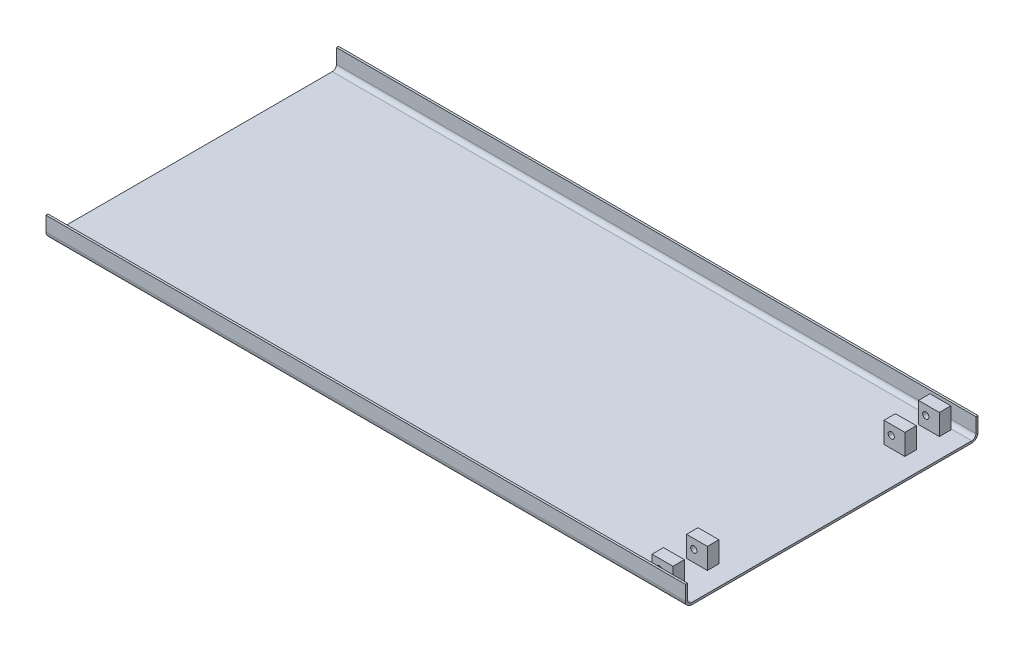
ISO-10303-21;
HEADER;
FILE_DESCRIPTION(('STEP AP214'),'2;1');
FILE_NAME('part.step','',(''),(''),'','','');
FILE_SCHEMA(('AUTOMOTIVE_DESIGN { 1 0 10303 214 1 1 1 1 }'));
ENDSEC;
DATA;
#1=APPLICATION_CONTEXT('core data for automotive mechanical design processes');
#2=APPLICATION_PROTOCOL_DEFINITION('international standard','automotive_design',2000,#1);
#3=PRODUCT_CONTEXT('',#1,'mechanical');
#4=PRODUCT('Part','Part','',(#3));
#5=PRODUCT_RELATED_PRODUCT_CATEGORY('part','',(#4));
#6=PRODUCT_DEFINITION_FORMATION('','',#4);
#7=PRODUCT_DEFINITION_CONTEXT('part definition',#1,'design');
#8=PRODUCT_DEFINITION('design','',#6,#7);
#9=PRODUCT_DEFINITION_SHAPE('','',#8);
#10=(LENGTH_UNIT() NAMED_UNIT(*) SI_UNIT(.MILLI.,.METRE.));
#11=(NAMED_UNIT(*) PLANE_ANGLE_UNIT() SI_UNIT($,.RADIAN.));
#12=(NAMED_UNIT(*) SI_UNIT($,.STERADIAN.) SOLID_ANGLE_UNIT());
#13=UNCERTAINTY_MEASURE_WITH_UNIT(LENGTH_MEASURE(1.E-05),#10,'distance_accuracy_value','');
#14=(GEOMETRIC_REPRESENTATION_CONTEXT(3) GLOBAL_UNCERTAINTY_ASSIGNED_CONTEXT((#13)) GLOBAL_UNIT_ASSIGNED_CONTEXT((#10,
#11,#12)) REPRESENTATION_CONTEXT('',''));
#15=CARTESIAN_POINT('',(0.,0.,0.));
#16=DIRECTION('',(0.,0.,1.));
#17=DIRECTION('',(1.,0.,0.));
#18=AXIS2_PLACEMENT_3D('',#15,#16,#17);
#19=CARTESIAN_POINT('',(1530.,10.,670.));
#20=DIRECTION('',(0.,-1.,0.));
#21=DIRECTION('',(0.,0.,-1.));
#22=AXIS2_PLACEMENT_3D('',#19,#20,#21);
#23=PLANE('',#22);
#24=DIRECTION('',(0.,0.,-1.));
#25=VECTOR('',#24,1.);
#26=CARTESIAN_POINT('',(1435.,10.,0.));
#27=LINE('',#26,#25);
#28=CARTESIAN_POINT('',(1435.,10.,-610.));
#29=VERTEX_POINT('',#28);
#30=CARTESIAN_POINT('',(1435.,10.,-665.));
#31=VERTEX_POINT('',#30);
#32=EDGE_CURVE('E258',#29,#31,#27,.T.);
#33=ORIENTED_EDGE('',*,*,#32,.F.);
#34=DIRECTION('',(-1.,0.,0.));
#35=VECTOR('',#34,1.);
#36=CARTESIAN_POINT('',(6.77236045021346E-13,10.,-610.000000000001));
#37=LINE('',#36,#35);
#38=CARTESIAN_POINT('',(1335.,10.,-610.));
#39=VERTEX_POINT('',#38);
#40=EDGE_CURVE('E230',#29,#39,#37,.T.);
#41=ORIENTED_EDGE('',*,*,#40,.T.);
#42=DIRECTION('',(0.,0.,-1.));
#43=VECTOR('',#42,1.);
#44=CARTESIAN_POINT('',(1335.,10.,0.));
#45=LINE('',#44,#43);
#46=CARTESIAN_POINT('',(1335.,10.,-665.));
#47=VERTEX_POINT('',#46);
#48=EDGE_CURVE('E246',#39,#47,#45,.T.);
#49=ORIENTED_EDGE('',*,*,#48,.T.);
#50=DIRECTION('',(-1.,0.,0.));
#51=VECTOR('',#50,1.);
#52=CARTESIAN_POINT('',(-7.38298311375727E-13,10.,-664.999999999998));
#53=LINE('',#52,#51);
#54=EDGE_CURVE('E50',#31,#47,#53,.T.);
#55=ORIENTED_EDGE('',*,*,#54,.F.);
#56=EDGE_LOOP('',(#33,#41,#49,#55));
#57=FACE_BOUND('',#56,.T.);
#58=DIRECTION('',(0.,0.,-1.));
#59=VECTOR('',#58,1.);
#60=CARTESIAN_POINT('',(1435.,10.,0.));
#61=LINE('',#60,#59);
#62=CARTESIAN_POINT('',(1435.,10.,-445.));
#63=VERTEX_POINT('',#62);
#64=CARTESIAN_POINT('',(1435.,10.,-500.));
#65=VERTEX_POINT('',#64);
#66=EDGE_CURVE('E279',#63,#65,#61,.T.);
#67=ORIENTED_EDGE('',*,*,#66,.F.);
#68=DIRECTION('',(-1.,0.,0.));
#69=VECTOR('',#68,1.);
#70=CARTESIAN_POINT('',(4.94049245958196E-13,10.,-445.000000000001));
#71=LINE('',#70,#69);
#72=CARTESIAN_POINT('',(1335.,10.,-445.));
#73=VERTEX_POINT('',#72);
#74=EDGE_CURVE('E233',#63,#73,#71,.T.);
#75=ORIENTED_EDGE('',*,*,#74,.T.);
#76=DIRECTION('',(0.,0.,-1.));
#77=VECTOR('',#76,1.);
#78=CARTESIAN_POINT('',(1335.,10.,0.));
#79=LINE('',#78,#77);
#80=CARTESIAN_POINT('',(1335.,10.,-500.));
#81=VERTEX_POINT('',#80);
#82=EDGE_CURVE('E269',#73,#81,#79,.T.);
#83=ORIENTED_EDGE('',*,*,#82,.T.);
#84=DIRECTION('',(-1.,0.,0.));
#85=VECTOR('',#84,1.);
#86=CARTESIAN_POINT('',(-5.55111512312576E-13,10.,-499.999999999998));
#87=LINE('',#86,#85);
#88=EDGE_CURVE('E58',#65,#81,#87,.T.);
#89=ORIENTED_EDGE('',*,*,#88,.F.);
#90=EDGE_LOOP('',(#67,#75,#83,#89));
#91=FACE_BOUND('',#90,.T.);
#92=DIRECTION('',(-1.,0.,0.));
#93=VECTOR('',#92,1.);
#94=CARTESIAN_POINT('',(6.77236045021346E-13,10.,610.000000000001));
#95=LINE('',#94,#93);
#96=CARTESIAN_POINT('',(1435.,10.,610.));
#97=VERTEX_POINT('',#96);
#98=CARTESIAN_POINT('',(1335.,10.,610.));
#99=VERTEX_POINT('',#98);
#100=EDGE_CURVE('E323',#97,#99,#95,.T.);
#101=ORIENTED_EDGE('',*,*,#100,.F.);
#102=DIRECTION('',(0.,0.,1.));
#103=VECTOR('',#102,1.);
#104=CARTESIAN_POINT('',(1435.,10.,0.));
#105=LINE('',#104,#103);
#106=CARTESIAN_POINT('',(1435.,10.,665.));
#107=VERTEX_POINT('',#106);
#108=EDGE_CURVE('E328',#97,#107,#105,.T.);
#109=ORIENTED_EDGE('',*,*,#108,.T.);
#110=DIRECTION('',(-1.,0.,0.));
#111=VECTOR('',#110,1.);
#112=CARTESIAN_POINT('',(-7.38298311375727E-13,10.,664.999999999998));
#113=LINE('',#112,#111);
#114=CARTESIAN_POINT('',(1335.,10.,665.));
#115=VERTEX_POINT('',#114);
#116=EDGE_CURVE('E342',#107,#115,#113,.T.);
#117=ORIENTED_EDGE('',*,*,#116,.T.);
#118=DIRECTION('',(0.,0.,1.));
#119=VECTOR('',#118,1.);
#120=CARTESIAN_POINT('',(1335.,10.,0.));
#121=LINE('',#120,#119);
#122=EDGE_CURVE('E339',#99,#115,#121,.T.);
#123=ORIENTED_EDGE('',*,*,#122,.F.);
#124=EDGE_LOOP('',(#101,#109,#117,#123));
#125=FACE_BOUND('',#124,.T.);
#126=DIRECTION('',(0.,0.,-1.));
#127=VECTOR('',#126,1.);
#128=CARTESIAN_POINT('',(-1530.,10.,670.));
#129=LINE('',#128,#127);
#130=CARTESIAN_POINT('',(-1530.,10.,-670.));
#131=VERTEX_POINT('',#130);
#132=CARTESIAN_POINT('',(-1530.,9.99999999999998,670.));
#133=VERTEX_POINT('',#132);
#134=EDGE_CURVE('E416',#131,#133,#129,.F.);
#135=ORIENTED_EDGE('',*,*,#134,.T.);
#136=DIRECTION('',(-1.,0.,0.));
#137=VECTOR('',#136,1.);
#138=CARTESIAN_POINT('',(1530.,9.99999999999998,670.));
#139=LINE('',#138,#137);
#140=CARTESIAN_POINT('',(1530.,9.99999999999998,670.));
#141=VERTEX_POINT('',#140);
#142=EDGE_CURVE('E421',#141,#133,#139,.T.);
#143=ORIENTED_EDGE('',*,*,#142,.F.);
#144=DIRECTION('',(0.,0.,-1.));
#145=VECTOR('',#144,1.);
#146=CARTESIAN_POINT('',(1530.,10.,670.));
#147=LINE('',#146,#145);
#148=CARTESIAN_POINT('',(1530.,10.,-670.));
#149=VERTEX_POINT('',#148);
#150=EDGE_CURVE('E384',#149,#141,#147,.F.);
#151=ORIENTED_EDGE('',*,*,#150,.F.);
#152=DIRECTION('',(-1.,0.,0.));
#153=VECTOR('',#152,1.);
#154=CARTESIAN_POINT('',(1530.,10.,-670.));
#155=LINE('',#154,#153);
#156=EDGE_CURVE('E424',#149,#131,#155,.T.);
#157=ORIENTED_EDGE('',*,*,#156,.T.);
#158=EDGE_LOOP('',(#135,#143,#151,#157));
#159=FACE_BOUND('',#158,.T.);
#160=DIRECTION('',(-1.,0.,0.));
#161=VECTOR('',#160,1.);
#162=CARTESIAN_POINT('',(4.94049245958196E-13,10.,445.000000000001));
#163=LINE('',#162,#161);
#164=CARTESIAN_POINT('',(1435.,10.,445.));
#165=VERTEX_POINT('',#164);
#166=CARTESIAN_POINT('',(1335.,10.,445.));
#167=VERTEX_POINT('',#166);
#168=EDGE_CURVE('E291',#165,#167,#163,.T.);
#169=ORIENTED_EDGE('',*,*,#168,.F.);
#170=DIRECTION('',(0.,0.,1.));
#171=VECTOR('',#170,1.);
#172=CARTESIAN_POINT('',(1435.,10.,0.));
#173=LINE('',#172,#171);
#174=CARTESIAN_POINT('',(1435.,10.,500.));
#175=VERTEX_POINT('',#174);
#176=EDGE_CURVE('E296',#165,#175,#173,.T.);
#177=ORIENTED_EDGE('',*,*,#176,.T.);
#178=DIRECTION('',(-1.,0.,0.));
#179=VECTOR('',#178,1.);
#180=CARTESIAN_POINT('',(-5.55111512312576E-13,10.,499.999999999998));
#181=LINE('',#180,#179);
#182=CARTESIAN_POINT('',(1335.,10.,500.));
#183=VERTEX_POINT('',#182);
#184=EDGE_CURVE('E310',#175,#183,#181,.T.);
#185=ORIENTED_EDGE('',*,*,#184,.T.);
#186=DIRECTION('',(0.,0.,1.));
#187=VECTOR('',#186,1.);
#188=CARTESIAN_POINT('',(1335.,10.,0.));
#189=LINE('',#188,#187);
#190=EDGE_CURVE('E307',#167,#183,#189,.T.);
#191=ORIENTED_EDGE('',*,*,#190,.F.);
#192=EDGE_LOOP('',(#169,#177,#185,#191));
#193=FACE_BOUND('',#192,.T.);
#194=ADVANCED_FACE('F35',(#57,#91,#125,#159,#193),#23,.F.);
#195=CARTESIAN_POINT('',(1530.,30.0000000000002,690.));
#196=DIRECTION('',(0.,0.,1.));
#197=DIRECTION('',(1.,0.,0.));
#198=AXIS2_PLACEMENT_3D('',#195,#196,#197);
#199=PLANE('',#198);
#200=DIRECTION('',(0.,1.,0.));
#201=VECTOR('',#200,1.);
#202=CARTESIAN_POINT('',(-1530.,30.0000000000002,690.));
#203=LINE('',#202,#201);
#204=CARTESIAN_POINT('',(-1530.,30.0000000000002,690.));
#205=VERTEX_POINT('',#204);
#206=CARTESIAN_POINT('',(-1530.,100.,690.));
#207=VERTEX_POINT('',#206);
#208=EDGE_CURVE('E355',#205,#207,#203,.T.);
#209=ORIENTED_EDGE('',*,*,#208,.T.);
#210=DIRECTION('',(-1.,0.,0.));
#211=VECTOR('',#210,1.);
#212=CARTESIAN_POINT('',(1530.,100.,690.));
#213=LINE('',#212,#211);
#214=CARTESIAN_POINT('',(1530.,100.,690.));
#215=VERTEX_POINT('',#214);
#216=EDGE_CURVE('E11',#215,#207,#213,.T.);
#217=ORIENTED_EDGE('',*,*,#216,.F.);
#218=DIRECTION('',(0.,1.,0.));
#219=VECTOR('',#218,1.);
#220=CARTESIAN_POINT('',(1530.,30.0000000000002,690.));
#221=LINE('',#220,#219);
#222=CARTESIAN_POINT('',(1530.,30.0000000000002,690.));
#223=VERTEX_POINT('',#222);
#224=EDGE_CURVE('E356',#223,#215,#221,.T.);
#225=ORIENTED_EDGE('',*,*,#224,.F.);
#226=DIRECTION('',(-1.,0.,0.));
#227=VECTOR('',#226,1.);
#228=CARTESIAN_POINT('',(1530.,30.0000000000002,690.));
#229=LINE('',#228,#227);
#230=EDGE_CURVE('E388',#223,#205,#229,.T.);
#231=ORIENTED_EDGE('',*,*,#230,.T.);
#232=EDGE_LOOP('',(#209,#217,#225,#231));
#233=FACE_BOUND('',#232,.T.);
#234=ADVANCED_FACE('F37',(#233),#199,.F.);
#235=CARTESIAN_POINT('',(1530.,100.,700.));
#236=DIRECTION('',(0.,1.,0.));
#237=DIRECTION('',(0.,0.,1.));
#238=AXIS2_PLACEMENT_3D('',#235,#236,#237);
#239=PLANE('',#238);
#240=DIRECTION('',(0.,0.,-1.));
#241=VECTOR('',#240,1.);
#242=CARTESIAN_POINT('',(-1530.,100.,700.));
#243=LINE('',#242,#241);
#244=CARTESIAN_POINT('',(-1530.,100.,700.));
#245=VERTEX_POINT('',#244);
#246=EDGE_CURVE('E391',#245,#207,#243,.T.);
#247=ORIENTED_EDGE('',*,*,#246,.F.);
#248=DIRECTION('',(-1.,0.,0.));
#249=VECTOR('',#248,1.);
#250=CARTESIAN_POINT('',(1530.,100.,700.));
#251=LINE('',#250,#249);
#252=CARTESIAN_POINT('',(1530.,100.,700.));
#253=VERTEX_POINT('',#252);
#254=EDGE_CURVE('E43',#253,#245,#251,.T.);
#255=ORIENTED_EDGE('',*,*,#254,.F.);
#256=DIRECTION('',(0.,0.,-1.));
#257=VECTOR('',#256,1.);
#258=CARTESIAN_POINT('',(1530.,100.,700.));
#259=LINE('',#258,#257);
#260=EDGE_CURVE('E358',#253,#215,#259,.T.);
#261=ORIENTED_EDGE('',*,*,#260,.T.);
#262=ORIENTED_EDGE('',*,*,#216,.T.);
#263=EDGE_LOOP('',(#247,#255,#261,#262));
#264=FACE_BOUND('',#263,.T.);
#265=ADVANCED_FACE('F448',(#264),#239,.T.);
#266=CARTESIAN_POINT('',(1530.,30.0000000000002,700.));
#267=DIRECTION('',(0.,0.,1.));
#268=DIRECTION('',(1.,0.,0.));
#269=AXIS2_PLACEMENT_3D('',#266,#267,#268);
#270=PLANE('',#269);
#271=DIRECTION('',(0.,1.,0.));
#272=VECTOR('',#271,1.);
#273=CARTESIAN_POINT('',(-1530.,30.0000000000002,700.));
#274=LINE('',#273,#272);
#275=CARTESIAN_POINT('',(-1530.,30.0000000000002,700.));
#276=VERTEX_POINT('',#275);
#277=EDGE_CURVE('E394',#276,#245,#274,.T.);
#278=ORIENTED_EDGE('',*,*,#277,.F.);
#279=DIRECTION('',(-1.,0.,0.));
#280=VECTOR('',#279,1.);
#281=CARTESIAN_POINT('',(1530.,30.0000000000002,700.));
#282=LINE('',#281,#280);
#283=CARTESIAN_POINT('',(1530.,30.0000000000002,700.));
#284=VERTEX_POINT('',#283);
#285=EDGE_CURVE('E440',#284,#276,#282,.T.);
#286=ORIENTED_EDGE('',*,*,#285,.F.);
#287=DIRECTION('',(0.,1.,0.));
#288=VECTOR('',#287,1.);
#289=CARTESIAN_POINT('',(1530.,30.0000000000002,700.));
#290=LINE('',#289,#288);
#291=EDGE_CURVE('E362',#284,#253,#290,.T.);
#292=ORIENTED_EDGE('',*,*,#291,.T.);
#293=ORIENTED_EDGE('',*,*,#254,.T.);
#294=EDGE_LOOP('',(#278,#286,#292,#293));
#295=FACE_BOUND('',#294,.T.);
#296=ADVANCED_FACE('F444',(#295),#270,.T.);
#297=CARTESIAN_POINT('',(1530.,30.,670.));
#298=DIRECTION('',(-1.,0.,0.));
#299=DIRECTION('',(0.,0.,1.));
#300=AXIS2_PLACEMENT_3D('',#297,#298,#299);
#301=CYLINDRICAL_SURFACE('',#300,30.);
#302=CARTESIAN_POINT('',(-1530.,30.,670.));
#303=DIRECTION('',(-1.,0.,0.));
#304=DIRECTION('',(0.,0.,-1.));
#305=AXIS2_PLACEMENT_3D('',#302,#303,#304);
#306=CIRCLE('',#305,30.);
#307=CARTESIAN_POINT('',(-1530.,0.,670.));
#308=VERTEX_POINT('',#307);
#309=EDGE_CURVE('E397',#308,#276,#306,.T.);
#310=ORIENTED_EDGE('',*,*,#309,.F.);
#311=DIRECTION('',(-1.,0.,0.));
#312=VECTOR('',#311,1.);
#313=CARTESIAN_POINT('',(1530.,0.,670.));
#314=LINE('',#313,#312);
#315=CARTESIAN_POINT('',(1530.,0.,670.));
#316=VERTEX_POINT('',#315);
#317=EDGE_CURVE('E438',#316,#308,#314,.T.);
#318=ORIENTED_EDGE('',*,*,#317,.F.);
#319=CARTESIAN_POINT('',(1530.,30.,670.));
#320=DIRECTION('',(-1.,0.,0.));
#321=DIRECTION('',(0.,0.,-1.));
#322=AXIS2_PLACEMENT_3D('',#319,#320,#321);
#323=CIRCLE('',#322,30.);
#324=EDGE_CURVE('E365',#316,#284,#323,.T.);
#325=ORIENTED_EDGE('',*,*,#324,.T.);
#326=ORIENTED_EDGE('',*,*,#285,.T.);
#327=EDGE_LOOP('',(#310,#318,#325,#326));
#328=FACE_BOUND('',#327,.T.);
#329=ADVANCED_FACE('F456',(#328),#301,.T.);
#330=CARTESIAN_POINT('',(1530.,0.,670.));
#331=DIRECTION('',(0.,-1.,0.));
#332=DIRECTION('',(0.,0.,-1.));
#333=AXIS2_PLACEMENT_3D('',#330,#331,#332);
#334=PLANE('',#333);
#335=DIRECTION('',(0.,0.,1.));
#336=VECTOR('',#335,1.);
#337=CARTESIAN_POINT('',(-1530.,0.,670.));
#338=LINE('',#337,#336);
#339=CARTESIAN_POINT('',(-1530.,0.,-670.));
#340=VERTEX_POINT('',#339);
#341=EDGE_CURVE('E400',#340,#308,#338,.T.);
#342=ORIENTED_EDGE('',*,*,#341,.F.);
#343=DIRECTION('',(-1.,0.,0.));
#344=VECTOR('',#343,1.);
#345=CARTESIAN_POINT('',(1530.,0.,-670.));
#346=LINE('',#345,#344);
#347=CARTESIAN_POINT('',(1530.,0.,-670.));
#348=VERTEX_POINT('',#347);
#349=EDGE_CURVE('E436',#348,#340,#346,.T.);
#350=ORIENTED_EDGE('',*,*,#349,.F.);
#351=DIRECTION('',(0.,0.,1.));
#352=VECTOR('',#351,1.);
#353=CARTESIAN_POINT('',(1530.,0.,670.));
#354=LINE('',#353,#352);
#355=EDGE_CURVE('E368',#348,#316,#354,.T.);
#356=ORIENTED_EDGE('',*,*,#355,.T.);
#357=ORIENTED_EDGE('',*,*,#317,.T.);
#358=EDGE_LOOP('',(#342,#350,#356,#357));
#359=FACE_BOUND('',#358,.T.);
#360=ADVANCED_FACE('F495',(#359),#334,.T.);
#361=CARTESIAN_POINT('',(1530.,30.,-670.));
#362=DIRECTION('',(-1.,0.,0.));
#363=DIRECTION('',(0.,0.,1.));
#364=AXIS2_PLACEMENT_3D('',#361,#362,#363);
#365=CYLINDRICAL_SURFACE('',#364,30.);
#366=CARTESIAN_POINT('',(-1530.,30.,-670.));
#367=DIRECTION('',(-1.,0.,0.));
#368=DIRECTION('',(0.,0.,-1.));
#369=AXIS2_PLACEMENT_3D('',#366,#367,#368);
#370=CIRCLE('',#369,30.);
#371=CARTESIAN_POINT('',(-1530.,30.0000000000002,-700.));
#372=VERTEX_POINT('',#371);
#373=EDGE_CURVE('E403',#372,#340,#370,.T.);
#374=ORIENTED_EDGE('',*,*,#373,.F.);
#375=DIRECTION('',(-1.,0.,0.));
#376=VECTOR('',#375,1.);
#377=CARTESIAN_POINT('',(1530.,30.0000000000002,-700.));
#378=LINE('',#377,#376);
#379=CARTESIAN_POINT('',(1530.,30.0000000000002,-700.));
#380=VERTEX_POINT('',#379);
#381=EDGE_CURVE('E434',#380,#372,#378,.T.);
#382=ORIENTED_EDGE('',*,*,#381,.F.);
#383=CARTESIAN_POINT('',(1530.,30.,-670.));
#384=DIRECTION('',(-1.,0.,0.));
#385=DIRECTION('',(0.,0.,-1.));
#386=AXIS2_PLACEMENT_3D('',#383,#384,#385);
#387=CIRCLE('',#386,30.);
#388=EDGE_CURVE('E371',#380,#348,#387,.T.);
#389=ORIENTED_EDGE('',*,*,#388,.T.);
#390=ORIENTED_EDGE('',*,*,#349,.T.);
#391=EDGE_LOOP('',(#374,#382,#389,#390));
#392=FACE_BOUND('',#391,.T.);
#393=ADVANCED_FACE('F492',(#392),#365,.T.);
#394=CARTESIAN_POINT('',(1530.,30.0000000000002,-700.));
#395=DIRECTION('',(0.,0.,-1.));
#396=DIRECTION('',(-1.,0.,0.));
#397=AXIS2_PLACEMENT_3D('',#394,#395,#396);
#398=PLANE('',#397);
#399=DIRECTION('',(0.,-1.,0.));
#400=VECTOR('',#399,1.);
#401=CARTESIAN_POINT('',(-1530.,30.0000000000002,-700.));
#402=LINE('',#401,#400);
#403=CARTESIAN_POINT('',(-1530.,100.,-700.));
#404=VERTEX_POINT('',#403);
#405=EDGE_CURVE('E406',#404,#372,#402,.T.);
#406=ORIENTED_EDGE('',*,*,#405,.F.);
#407=DIRECTION('',(-1.,0.,0.));
#408=VECTOR('',#407,1.);
#409=CARTESIAN_POINT('',(1530.,100.,-700.));
#410=LINE('',#409,#408);
#411=CARTESIAN_POINT('',(1530.,100.,-700.));
#412=VERTEX_POINT('',#411);
#413=EDGE_CURVE('E432',#412,#404,#410,.T.);
#414=ORIENTED_EDGE('',*,*,#413,.F.);
#415=DIRECTION('',(0.,-1.,0.));
#416=VECTOR('',#415,1.);
#417=CARTESIAN_POINT('',(1530.,30.0000000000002,-700.));
#418=LINE('',#417,#416);
#419=EDGE_CURVE('E374',#412,#380,#418,.T.);
#420=ORIENTED_EDGE('',*,*,#419,.T.);
#421=ORIENTED_EDGE('',*,*,#381,.T.);
#422=EDGE_LOOP('',(#406,#414,#420,#421));
#423=FACE_BOUND('',#422,.T.);
#424=ADVANCED_FACE('F489',(#423),#398,.T.);
#425=CARTESIAN_POINT('',(1530.,100.,-690.));
#426=DIRECTION('',(0.,1.,0.));
#427=DIRECTION('',(0.,0.,1.));
#428=AXIS2_PLACEMENT_3D('',#425,#426,#427);
#429=PLANE('',#428);
#430=DIRECTION('',(0.,0.,-1.));
#431=VECTOR('',#430,1.);
#432=CARTESIAN_POINT('',(-1530.,100.,-690.));
#433=LINE('',#432,#431);
#434=CARTESIAN_POINT('',(-1530.,100.,-690.));
#435=VERTEX_POINT('',#434);
#436=EDGE_CURVE('E409',#435,#404,#433,.T.);
#437=ORIENTED_EDGE('',*,*,#436,.F.);
#438=DIRECTION('',(-1.,0.,0.));
#439=VECTOR('',#438,1.);
#440=CARTESIAN_POINT('',(1530.,100.,-690.));
#441=LINE('',#440,#439);
#442=CARTESIAN_POINT('',(1530.,100.,-690.));
#443=VERTEX_POINT('',#442);
#444=EDGE_CURVE('E430',#443,#435,#441,.T.);
#445=ORIENTED_EDGE('',*,*,#444,.F.);
#446=DIRECTION('',(0.,0.,-1.));
#447=VECTOR('',#446,1.);
#448=CARTESIAN_POINT('',(1530.,100.,-690.));
#449=LINE('',#448,#447);
#450=EDGE_CURVE('E377',#443,#412,#449,.T.);
#451=ORIENTED_EDGE('',*,*,#450,.T.);
#452=ORIENTED_EDGE('',*,*,#413,.T.);
#453=EDGE_LOOP('',(#437,#445,#451,#452));
#454=FACE_BOUND('',#453,.T.);
#455=ADVANCED_FACE('F483',(#454),#429,.T.);
#456=CARTESIAN_POINT('',(1530.,30.0000000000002,-690.));
#457=DIRECTION('',(0.,0.,-1.));
#458=DIRECTION('',(-1.,0.,0.));
#459=AXIS2_PLACEMENT_3D('',#456,#457,#458);
#460=PLANE('',#459);
#461=DIRECTION('',(0.,1.,0.));
#462=VECTOR('',#461,1.);
#463=CARTESIAN_POINT('',(-1530.,30.0000000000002,-690.));
#464=LINE('',#463,#462);
#465=CARTESIAN_POINT('',(-1530.,30.0000000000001,-690.));
#466=VERTEX_POINT('',#465);
#467=EDGE_CURVE('E412',#435,#466,#464,.F.);
#468=ORIENTED_EDGE('',*,*,#467,.T.);
#469=DIRECTION('',(-1.,0.,0.));
#470=VECTOR('',#469,1.);
#471=CARTESIAN_POINT('',(1530.,30.0000000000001,-690.));
#472=LINE('',#471,#470);
#473=CARTESIAN_POINT('',(1530.,30.0000000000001,-690.));
#474=VERTEX_POINT('',#473);
#475=EDGE_CURVE('E427',#474,#466,#472,.T.);
#476=ORIENTED_EDGE('',*,*,#475,.F.);
#477=DIRECTION('',(0.,1.,0.));
#478=VECTOR('',#477,1.);
#479=CARTESIAN_POINT('',(1530.,30.0000000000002,-690.));
#480=LINE('',#479,#478);
#481=EDGE_CURVE('E380',#443,#474,#480,.F.);
#482=ORIENTED_EDGE('',*,*,#481,.F.);
#483=ORIENTED_EDGE('',*,*,#444,.T.);
#484=EDGE_LOOP('',(#468,#476,#482,#483));
#485=FACE_BOUND('',#484,.T.);
#486=ADVANCED_FACE('F496',(#485),#460,.F.);
#487=CARTESIAN_POINT('',(1530.,30.,-670.));
#488=DIRECTION('',(-1.,0.,0.));
#489=DIRECTION('',(0.,0.,1.));
#490=AXIS2_PLACEMENT_3D('',#487,#488,#489);
#491=CYLINDRICAL_SURFACE('',#490,20.);
#492=CARTESIAN_POINT('',(-1530.,30.,-670.));
#493=DIRECTION('',(1.,0.,0.));
#494=DIRECTION('',(0.,0.,-1.));
#495=AXIS2_PLACEMENT_3D('',#492,#493,#494);
#496=CIRCLE('',#495,20.);
#497=EDGE_CURVE('E414',#466,#131,#496,.F.);
#498=ORIENTED_EDGE('',*,*,#497,.T.);
#499=ORIENTED_EDGE('',*,*,#156,.F.);
#500=CARTESIAN_POINT('',(1530.,30.,-670.));
#501=DIRECTION('',(1.,0.,0.));
#502=DIRECTION('',(0.,0.,-1.));
#503=AXIS2_PLACEMENT_3D('',#500,#501,#502);
#504=CIRCLE('',#503,20.);
#505=EDGE_CURVE('E382',#474,#149,#504,.F.);
#506=ORIENTED_EDGE('',*,*,#505,.F.);
#507=ORIENTED_EDGE('',*,*,#475,.T.);
#508=EDGE_LOOP('',(#498,#499,#506,#507));
#509=FACE_BOUND('',#508,.T.);
#510=ADVANCED_FACE('F477',(#509),#491,.F.);
#511=CARTESIAN_POINT('',(1530.,30.,670.));
#512=DIRECTION('',(-1.,0.,0.));
#513=DIRECTION('',(0.,0.,1.));
#514=AXIS2_PLACEMENT_3D('',#511,#512,#513);
#515=CYLINDRICAL_SURFACE('',#514,20.);
#516=CARTESIAN_POINT('',(-1530.,30.,670.));
#517=DIRECTION('',(1.,0.,0.));
#518=DIRECTION('',(0.,0.,-1.));
#519=AXIS2_PLACEMENT_3D('',#516,#517,#518);
#520=CIRCLE('',#519,20.);
#521=EDGE_CURVE('E359',#133,#205,#520,.F.);
#522=ORIENTED_EDGE('',*,*,#521,.T.);
#523=ORIENTED_EDGE('',*,*,#230,.F.);
#524=CARTESIAN_POINT('',(1530.,30.,670.));
#525=DIRECTION('',(1.,0.,0.));
#526=DIRECTION('',(0.,0.,-1.));
#527=AXIS2_PLACEMENT_3D('',#524,#525,#526);
#528=CIRCLE('',#527,20.);
#529=EDGE_CURVE('E386',#141,#223,#528,.F.);
#530=ORIENTED_EDGE('',*,*,#529,.F.);
#531=ORIENTED_EDGE('',*,*,#142,.T.);
#532=EDGE_LOOP('',(#522,#523,#530,#531));
#533=FACE_BOUND('',#532,.T.);
#534=ADVANCED_FACE('F469',(#533),#515,.F.);
#535=CARTESIAN_POINT('',(1530.,30.,670.));
#536=DIRECTION('',(-1.,0.,0.));
#537=DIRECTION('',(0.,0.,1.));
#538=AXIS2_PLACEMENT_3D('',#535,#536,#537);
#539=PLANE('',#538);
#540=ORIENTED_EDGE('',*,*,#224,.T.);
#541=ORIENTED_EDGE('',*,*,#260,.F.);
#542=ORIENTED_EDGE('',*,*,#291,.F.);
#543=ORIENTED_EDGE('',*,*,#324,.F.);
#544=ORIENTED_EDGE('',*,*,#355,.F.);
#545=ORIENTED_EDGE('',*,*,#388,.F.);
#546=ORIENTED_EDGE('',*,*,#419,.F.);
#547=ORIENTED_EDGE('',*,*,#450,.F.);
#548=ORIENTED_EDGE('',*,*,#481,.T.);
#549=ORIENTED_EDGE('',*,*,#505,.T.);
#550=ORIENTED_EDGE('',*,*,#150,.T.);
#551=ORIENTED_EDGE('',*,*,#529,.T.);
#552=EDGE_LOOP('',(#540,#541,#542,#543,#544,#545,#546,#547,#548,#549,#550,#551));
#553=FACE_BOUND('',#552,.T.);
#554=ADVANCED_FACE('F459',(#553),#539,.F.);
#555=CARTESIAN_POINT('',(-1530.,30.,670.));
#556=DIRECTION('',(-1.,0.,0.));
#557=DIRECTION('',(0.,0.,1.));
#558=AXIS2_PLACEMENT_3D('',#555,#556,#557);
#559=PLANE('',#558);
#560=ORIENTED_EDGE('',*,*,#208,.F.);
#561=ORIENTED_EDGE('',*,*,#521,.F.);
#562=ORIENTED_EDGE('',*,*,#134,.F.);
#563=ORIENTED_EDGE('',*,*,#497,.F.);
#564=ORIENTED_EDGE('',*,*,#467,.F.);
#565=ORIENTED_EDGE('',*,*,#436,.T.);
#566=ORIENTED_EDGE('',*,*,#405,.T.);
#567=ORIENTED_EDGE('',*,*,#373,.T.);
#568=ORIENTED_EDGE('',*,*,#341,.T.);
#569=ORIENTED_EDGE('',*,*,#309,.T.);
#570=ORIENTED_EDGE('',*,*,#277,.T.);
#571=ORIENTED_EDGE('',*,*,#246,.T.);
#572=EDGE_LOOP('',(#560,#561,#562,#563,#564,#565,#566,#567,#568,#569,#570,#571));
#573=FACE_BOUND('',#572,.T.);
#574=ADVANCED_FACE('F452',(#573),#559,.T.);
#575=CARTESIAN_POINT('',(6.77236045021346E-13,110.,610.000000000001));
#576=DIRECTION('',(0.,0.,1.));
#577=DIRECTION('',(1.,0.,0.));
#578=AXIS2_PLACEMENT_3D('',#575,#576,#577);
#579=PLANE('',#578);
#580=CARTESIAN_POINT('',(1370.,65.,610.));
#581=DIRECTION('',(0.,0.,1.));
#582=DIRECTION('',(1.,0.,0.));
#583=AXIS2_PLACEMENT_3D('',#580,#581,#582);
#584=CIRCLE('',#583,14.9999999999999);
#585=CARTESIAN_POINT('',(1385.,65.,610.));
#586=VERTEX_POINT('',#585);
#587=EDGE_CURVE('E251',#586,#586,#584,.T.);
#588=ORIENTED_EDGE('',*,*,#587,.T.);
#589=EDGE_LOOP('',(#588));
#590=FACE_BOUND('',#589,.T.);
#591=ORIENTED_EDGE('',*,*,#100,.T.);
#592=DIRECTION('',(0.,-1.,0.));
#593=VECTOR('',#592,1.);
#594=CARTESIAN_POINT('',(1335.,110.,610.));
#595=LINE('',#594,#593);
#596=CARTESIAN_POINT('',(1335.,110.,610.));
#597=VERTEX_POINT('',#596);
#598=EDGE_CURVE('E353',#597,#99,#595,.T.);
#599=ORIENTED_EDGE('',*,*,#598,.F.);
#600=DIRECTION('',(-1.,0.,0.));
#601=VECTOR('',#600,1.);
#602=CARTESIAN_POINT('',(6.77236045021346E-13,110.,610.000000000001));
#603=LINE('',#602,#601);
#604=CARTESIAN_POINT('',(1435.,110.,610.));
#605=VERTEX_POINT('',#604);
#606=EDGE_CURVE('E324',#605,#597,#603,.T.);
#607=ORIENTED_EDGE('',*,*,#606,.F.);
#608=DIRECTION('',(0.,-1.,0.));
#609=VECTOR('',#608,1.);
#610=CARTESIAN_POINT('',(1435.,110.,610.));
#611=LINE('',#610,#609);
#612=EDGE_CURVE('E336',#605,#97,#611,.T.);
#613=ORIENTED_EDGE('',*,*,#612,.T.);
#614=EDGE_LOOP('',(#591,#599,#607,#613));
#615=FACE_BOUND('',#614,.T.);
#616=ADVANCED_FACE('F517',(#590,#615),#579,.F.);
#617=CARTESIAN_POINT('',(1335.,110.,0.));
#618=DIRECTION('',(1.,0.,0.));
#619=DIRECTION('',(0.,0.,-1.));
#620=AXIS2_PLACEMENT_3D('',#617,#618,#619);
#621=PLANE('',#620);
#622=ORIENTED_EDGE('',*,*,#122,.T.);
#623=DIRECTION('',(0.,-1.,0.));
#624=VECTOR('',#623,1.);
#625=CARTESIAN_POINT('',(1335.,110.,665.));
#626=LINE('',#625,#624);
#627=CARTESIAN_POINT('',(1335.,110.,665.));
#628=VERTEX_POINT('',#627);
#629=EDGE_CURVE('E351',#628,#115,#626,.T.);
#630=ORIENTED_EDGE('',*,*,#629,.F.);
#631=DIRECTION('',(0.,0.,1.));
#632=VECTOR('',#631,1.);
#633=CARTESIAN_POINT('',(1335.,110.,0.));
#634=LINE('',#633,#632);
#635=EDGE_CURVE('E327',#597,#628,#634,.T.);
#636=ORIENTED_EDGE('',*,*,#635,.F.);
#637=ORIENTED_EDGE('',*,*,#598,.T.);
#638=EDGE_LOOP('',(#622,#630,#636,#637));
#639=FACE_BOUND('',#638,.T.);
#640=ADVANCED_FACE('F522',(#639),#621,.F.);
#641=CARTESIAN_POINT('',(-7.38298311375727E-13,110.,664.999999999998));
#642=DIRECTION('',(0.,0.,1.));
#643=DIRECTION('',(1.,0.,0.));
#644=AXIS2_PLACEMENT_3D('',#641,#642,#643);
#645=PLANE('',#644);
#646=CARTESIAN_POINT('',(1370.,65.,664.999999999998));
#647=DIRECTION('',(0.,0.,1.));
#648=DIRECTION('',(1.,0.,0.));
#649=AXIS2_PLACEMENT_3D('',#646,#647,#648);
#650=CIRCLE('',#649,14.9999999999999);
#651=CARTESIAN_POINT('',(1385.,65.,664.999999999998));
#652=VERTEX_POINT('',#651);
#653=EDGE_CURVE('E615',#652,#652,#650,.T.);
#654=ORIENTED_EDGE('',*,*,#653,.F.);
#655=EDGE_LOOP('',(#654));
#656=FACE_BOUND('',#655,.T.);
#657=ORIENTED_EDGE('',*,*,#116,.F.);
#658=DIRECTION('',(0.,-1.,0.));
#659=VECTOR('',#658,1.);
#660=CARTESIAN_POINT('',(1435.,110.,665.));
#661=LINE('',#660,#659);
#662=CARTESIAN_POINT('',(1435.,110.,665.));
#663=VERTEX_POINT('',#662);
#664=EDGE_CURVE('E348',#663,#107,#661,.T.);
#665=ORIENTED_EDGE('',*,*,#664,.F.);
#666=DIRECTION('',(-1.,0.,0.));
#667=VECTOR('',#666,1.);
#668=CARTESIAN_POINT('',(-7.38298311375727E-13,110.,664.999999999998));
#669=LINE('',#668,#667);
#670=EDGE_CURVE('E330',#663,#628,#669,.T.);
#671=ORIENTED_EDGE('',*,*,#670,.T.);
#672=ORIENTED_EDGE('',*,*,#629,.T.);
#673=EDGE_LOOP('',(#657,#665,#671,#672));
#674=FACE_BOUND('',#673,.T.);
#675=ADVANCED_FACE('F526',(#656,#674),#645,.T.);
#676=CARTESIAN_POINT('',(1435.,110.,0.));
#677=DIRECTION('',(1.,0.,0.));
#678=DIRECTION('',(0.,0.,-1.));
#679=AXIS2_PLACEMENT_3D('',#676,#677,#678);
#680=PLANE('',#679);
#681=ORIENTED_EDGE('',*,*,#108,.F.);
#682=ORIENTED_EDGE('',*,*,#612,.F.);
#683=DIRECTION('',(0.,0.,1.));
#684=VECTOR('',#683,1.);
#685=CARTESIAN_POINT('',(1435.,110.,0.));
#686=LINE('',#685,#684);
#687=EDGE_CURVE('E333',#605,#663,#686,.T.);
#688=ORIENTED_EDGE('',*,*,#687,.T.);
#689=ORIENTED_EDGE('',*,*,#664,.T.);
#690=EDGE_LOOP('',(#681,#682,#688,#689));
#691=FACE_BOUND('',#690,.T.);
#692=ADVANCED_FACE('F530',(#691),#680,.T.);
#693=CARTESIAN_POINT('',(0.,110.,0.));
#694=DIRECTION('',(0.,1.,0.));
#695=DIRECTION('',(0.,0.,1.));
#696=AXIS2_PLACEMENT_3D('',#693,#694,#695);
#697=PLANE('',#696);
#698=ORIENTED_EDGE('',*,*,#606,.T.);
#699=ORIENTED_EDGE('',*,*,#635,.T.);
#700=ORIENTED_EDGE('',*,*,#670,.F.);
#701=ORIENTED_EDGE('',*,*,#687,.F.);
#702=EDGE_LOOP('',(#698,#699,#700,#701));
#703=FACE_BOUND('',#702,.T.);
#704=ADVANCED_FACE('F534',(#703),#697,.T.);
#705=CARTESIAN_POINT('',(4.94049245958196E-13,110.,445.000000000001));
#706=DIRECTION('',(0.,0.,1.));
#707=DIRECTION('',(1.,0.,0.));
#708=AXIS2_PLACEMENT_3D('',#705,#706,#707);
#709=PLANE('',#708);
#710=CARTESIAN_POINT('',(1370.,65.,445.));
#711=DIRECTION('',(0.,0.,1.));
#712=DIRECTION('',(1.,0.,0.));
#713=AXIS2_PLACEMENT_3D('',#710,#711,#712);
#714=CIRCLE('',#713,14.9999999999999);
#715=CARTESIAN_POINT('',(1385.,65.,445.));
#716=VERTEX_POINT('',#715);
#717=EDGE_CURVE('E618',#716,#716,#714,.T.);
#718=ORIENTED_EDGE('',*,*,#717,.T.);
#719=EDGE_LOOP('',(#718));
#720=FACE_BOUND('',#719,.T.);
#721=ORIENTED_EDGE('',*,*,#168,.T.);
#722=DIRECTION('',(0.,-1.,0.));
#723=VECTOR('',#722,1.);
#724=CARTESIAN_POINT('',(1335.,110.,445.));
#725=LINE('',#724,#723);
#726=CARTESIAN_POINT('',(1335.,110.,445.));
#727=VERTEX_POINT('',#726);
#728=EDGE_CURVE('E321',#727,#167,#725,.T.);
#729=ORIENTED_EDGE('',*,*,#728,.F.);
#730=DIRECTION('',(-1.,0.,0.));
#731=VECTOR('',#730,1.);
#732=CARTESIAN_POINT('',(4.94049245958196E-13,110.,445.000000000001));
#733=LINE('',#732,#731);
#734=CARTESIAN_POINT('',(1435.,110.,445.));
#735=VERTEX_POINT('',#734);
#736=EDGE_CURVE('E292',#735,#727,#733,.T.);
#737=ORIENTED_EDGE('',*,*,#736,.F.);
#738=DIRECTION('',(0.,-1.,0.));
#739=VECTOR('',#738,1.);
#740=CARTESIAN_POINT('',(1435.,110.,445.));
#741=LINE('',#740,#739);
#742=EDGE_CURVE('E304',#735,#165,#741,.T.);
#743=ORIENTED_EDGE('',*,*,#742,.T.);
#744=EDGE_LOOP('',(#721,#729,#737,#743));
#745=FACE_BOUND('',#744,.T.);
#746=ADVANCED_FACE('F538',(#720,#745),#709,.F.);
#747=CARTESIAN_POINT('',(1335.,110.,0.));
#748=DIRECTION('',(1.,0.,0.));
#749=DIRECTION('',(0.,0.,-1.));
#750=AXIS2_PLACEMENT_3D('',#747,#748,#749);
#751=PLANE('',#750);
#752=ORIENTED_EDGE('',*,*,#190,.T.);
#753=DIRECTION('',(0.,-1.,0.));
#754=VECTOR('',#753,1.);
#755=CARTESIAN_POINT('',(1335.,110.,500.));
#756=LINE('',#755,#754);
#757=CARTESIAN_POINT('',(1335.,110.,500.));
#758=VERTEX_POINT('',#757);
#759=EDGE_CURVE('E319',#758,#183,#756,.T.);
#760=ORIENTED_EDGE('',*,*,#759,.F.);
#761=DIRECTION('',(0.,0.,1.));
#762=VECTOR('',#761,1.);
#763=CARTESIAN_POINT('',(1335.,110.,0.));
#764=LINE('',#763,#762);
#765=EDGE_CURVE('E295',#727,#758,#764,.T.);
#766=ORIENTED_EDGE('',*,*,#765,.F.);
#767=ORIENTED_EDGE('',*,*,#728,.T.);
#768=EDGE_LOOP('',(#752,#760,#766,#767));
#769=FACE_BOUND('',#768,.T.);
#770=ADVANCED_FACE('F542',(#769),#751,.F.);
#771=CARTESIAN_POINT('',(-5.55111512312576E-13,110.,499.999999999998));
#772=DIRECTION('',(0.,0.,1.));
#773=DIRECTION('',(1.,0.,0.));
#774=AXIS2_PLACEMENT_3D('',#771,#772,#773);
#775=PLANE('',#774);
#776=CARTESIAN_POINT('',(1370.,65.,500.));
#777=DIRECTION('',(0.,0.,1.));
#778=DIRECTION('',(1.,0.,0.));
#779=AXIS2_PLACEMENT_3D('',#776,#777,#778);
#780=CIRCLE('',#779,14.9999999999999);
#781=CARTESIAN_POINT('',(1385.,65.,500.));
#782=VERTEX_POINT('',#781);
#783=EDGE_CURVE('E620',#782,#782,#780,.T.);
#784=ORIENTED_EDGE('',*,*,#783,.F.);
#785=EDGE_LOOP('',(#784));
#786=FACE_BOUND('',#785,.T.);
#787=ORIENTED_EDGE('',*,*,#184,.F.);
#788=DIRECTION('',(0.,-1.,0.));
#789=VECTOR('',#788,1.);
#790=CARTESIAN_POINT('',(1435.,110.,500.));
#791=LINE('',#790,#789);
#792=CARTESIAN_POINT('',(1435.,110.,500.));
#793=VERTEX_POINT('',#792);
#794=EDGE_CURVE('E316',#793,#175,#791,.T.);
#795=ORIENTED_EDGE('',*,*,#794,.F.);
#796=DIRECTION('',(-1.,0.,0.));
#797=VECTOR('',#796,1.);
#798=CARTESIAN_POINT('',(-5.55111512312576E-13,110.,499.999999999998));
#799=LINE('',#798,#797);
#800=EDGE_CURVE('E298',#793,#758,#799,.T.);
#801=ORIENTED_EDGE('',*,*,#800,.T.);
#802=ORIENTED_EDGE('',*,*,#759,.T.);
#803=EDGE_LOOP('',(#787,#795,#801,#802));
#804=FACE_BOUND('',#803,.T.);
#805=ADVANCED_FACE('F546',(#786,#804),#775,.T.);
#806=CARTESIAN_POINT('',(1435.,110.,0.));
#807=DIRECTION('',(1.,0.,0.));
#808=DIRECTION('',(0.,0.,-1.));
#809=AXIS2_PLACEMENT_3D('',#806,#807,#808);
#810=PLANE('',#809);
#811=ORIENTED_EDGE('',*,*,#176,.F.);
#812=ORIENTED_EDGE('',*,*,#742,.F.);
#813=DIRECTION('',(0.,0.,1.));
#814=VECTOR('',#813,1.);
#815=CARTESIAN_POINT('',(1435.,110.,0.));
#816=LINE('',#815,#814);
#817=EDGE_CURVE('E301',#735,#793,#816,.T.);
#818=ORIENTED_EDGE('',*,*,#817,.T.);
#819=ORIENTED_EDGE('',*,*,#794,.T.);
#820=EDGE_LOOP('',(#811,#812,#818,#819));
#821=FACE_BOUND('',#820,.T.);
#822=ADVANCED_FACE('F550',(#821),#810,.T.);
#823=CARTESIAN_POINT('',(0.,110.,0.));
#824=DIRECTION('',(0.,1.,0.));
#825=DIRECTION('',(0.,0.,1.));
#826=AXIS2_PLACEMENT_3D('',#823,#824,#825);
#827=PLANE('',#826);
#828=ORIENTED_EDGE('',*,*,#736,.T.);
#829=ORIENTED_EDGE('',*,*,#765,.T.);
#830=ORIENTED_EDGE('',*,*,#800,.F.);
#831=ORIENTED_EDGE('',*,*,#817,.F.);
#832=EDGE_LOOP('',(#828,#829,#830,#831));
#833=FACE_BOUND('',#832,.T.);
#834=ADVANCED_FACE('F554',(#833),#827,.T.);
#835=CARTESIAN_POINT('',(4.94049245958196E-13,110.,-445.000000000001));
#836=DIRECTION('',(0.,0.,1.));
#837=DIRECTION('',(1.,0.,0.));
#838=AXIS2_PLACEMENT_3D('',#835,#836,#837);
#839=PLANE('',#838);
#840=CARTESIAN_POINT('',(1370.,65.,-445.));
#841=DIRECTION('',(0.,0.,1.));
#842=DIRECTION('',(1.,0.,0.));
#843=AXIS2_PLACEMENT_3D('',#840,#841,#842);
#844=CIRCLE('',#843,14.9999999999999);
#845=CARTESIAN_POINT('',(1385.,65.,-445.));
#846=VERTEX_POINT('',#845);
#847=EDGE_CURVE('E623',#846,#846,#844,.T.);
#848=ORIENTED_EDGE('',*,*,#847,.F.);
#849=EDGE_LOOP('',(#848));
#850=FACE_BOUND('',#849,.T.);
#851=ORIENTED_EDGE('',*,*,#74,.F.);
#852=DIRECTION('',(0.,-1.,0.));
#853=VECTOR('',#852,1.);
#854=CARTESIAN_POINT('',(1435.,110.,-445.));
#855=LINE('',#854,#853);
#856=CARTESIAN_POINT('',(1435.,110.,-445.));
#857=VERTEX_POINT('',#856);
#858=EDGE_CURVE('E289',#857,#63,#855,.T.);
#859=ORIENTED_EDGE('',*,*,#858,.F.);
#860=DIRECTION('',(-1.,0.,0.));
#861=VECTOR('',#860,1.);
#862=CARTESIAN_POINT('',(4.94049245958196E-13,110.,-445.000000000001));
#863=LINE('',#862,#861);
#864=CARTESIAN_POINT('',(1335.,110.,-445.));
#865=VERTEX_POINT('',#864);
#866=EDGE_CURVE('E265',#857,#865,#863,.T.);
#867=ORIENTED_EDGE('',*,*,#866,.T.);
#868=DIRECTION('',(0.,-1.,0.));
#869=VECTOR('',#868,1.);
#870=CARTESIAN_POINT('',(1335.,110.,-445.));
#871=LINE('',#870,#869);
#872=EDGE_CURVE('E276',#865,#73,#871,.T.);
#873=ORIENTED_EDGE('',*,*,#872,.T.);
#874=EDGE_LOOP('',(#851,#859,#867,#873));
#875=FACE_BOUND('',#874,.T.);
#876=ADVANCED_FACE('F558',(#850,#875),#839,.T.);
#877=CARTESIAN_POINT('',(1435.,110.,0.));
#878=DIRECTION('',(-1.,0.,0.));
#879=DIRECTION('',(0.,0.,1.));
#880=AXIS2_PLACEMENT_3D('',#877,#878,#879);
#881=PLANE('',#880);
#882=ORIENTED_EDGE('',*,*,#66,.T.);
#883=DIRECTION('',(0.,-1.,0.));
#884=VECTOR('',#883,1.);
#885=CARTESIAN_POINT('',(1435.,110.,-500.));
#886=LINE('',#885,#884);
#887=CARTESIAN_POINT('',(1435.,110.,-500.));
#888=VERTEX_POINT('',#887);
#889=EDGE_CURVE('E287',#888,#65,#886,.T.);
#890=ORIENTED_EDGE('',*,*,#889,.F.);
#891=DIRECTION('',(0.,0.,-1.));
#892=VECTOR('',#891,1.);
#893=CARTESIAN_POINT('',(1435.,110.,0.));
#894=LINE('',#893,#892);
#895=EDGE_CURVE('E268',#857,#888,#894,.T.);
#896=ORIENTED_EDGE('',*,*,#895,.F.);
#897=ORIENTED_EDGE('',*,*,#858,.T.);
#898=EDGE_LOOP('',(#882,#890,#896,#897));
#899=FACE_BOUND('',#898,.T.);
#900=ADVANCED_FACE('F562',(#899),#881,.F.);
#901=CARTESIAN_POINT('',(-5.55111512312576E-13,110.,-499.999999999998));
#902=DIRECTION('',(0.,0.,1.));
#903=DIRECTION('',(1.,0.,0.));
#904=AXIS2_PLACEMENT_3D('',#901,#902,#903);
#905=PLANE('',#904);
#906=CARTESIAN_POINT('',(1370.,65.,-500.));
#907=DIRECTION('',(0.,0.,1.));
#908=DIRECTION('',(1.,0.,0.));
#909=AXIS2_PLACEMENT_3D('',#906,#907,#908);
#910=CIRCLE('',#909,14.9999999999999);
#911=CARTESIAN_POINT('',(1385.,65.,-500.));
#912=VERTEX_POINT('',#911);
#913=EDGE_CURVE('E628',#912,#912,#910,.T.);
#914=ORIENTED_EDGE('',*,*,#913,.T.);
#915=EDGE_LOOP('',(#914));
#916=FACE_BOUND('',#915,.T.);
#917=ORIENTED_EDGE('',*,*,#88,.T.);
#918=DIRECTION('',(0.,-1.,0.));
#919=VECTOR('',#918,1.);
#920=CARTESIAN_POINT('',(1335.,110.,-500.));
#921=LINE('',#920,#919);
#922=CARTESIAN_POINT('',(1335.,110.,-500.));
#923=VERTEX_POINT('',#922);
#924=EDGE_CURVE('E285',#923,#81,#921,.T.);
#925=ORIENTED_EDGE('',*,*,#924,.F.);
#926=DIRECTION('',(-1.,0.,0.));
#927=VECTOR('',#926,1.);
#928=CARTESIAN_POINT('',(-5.55111512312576E-13,110.,-499.999999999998));
#929=LINE('',#928,#927);
#930=EDGE_CURVE('E271',#888,#923,#929,.T.);
#931=ORIENTED_EDGE('',*,*,#930,.F.);
#932=ORIENTED_EDGE('',*,*,#889,.T.);
#933=EDGE_LOOP('',(#917,#925,#931,#932));
#934=FACE_BOUND('',#933,.T.);
#935=ADVANCED_FACE('F566',(#916,#934),#905,.F.);
#936=CARTESIAN_POINT('',(1335.,110.,0.));
#937=DIRECTION('',(-1.,0.,0.));
#938=DIRECTION('',(0.,0.,1.));
#939=AXIS2_PLACEMENT_3D('',#936,#937,#938);
#940=PLANE('',#939);
#941=ORIENTED_EDGE('',*,*,#82,.F.);
#942=ORIENTED_EDGE('',*,*,#872,.F.);
#943=DIRECTION('',(0.,0.,-1.));
#944=VECTOR('',#943,1.);
#945=CARTESIAN_POINT('',(1335.,110.,0.));
#946=LINE('',#945,#944);
#947=EDGE_CURVE('E273',#865,#923,#946,.T.);
#948=ORIENTED_EDGE('',*,*,#947,.T.);
#949=ORIENTED_EDGE('',*,*,#924,.T.);
#950=EDGE_LOOP('',(#941,#942,#948,#949));
#951=FACE_BOUND('',#950,.T.);
#952=ADVANCED_FACE('F570',(#951),#940,.T.);
#953=CARTESIAN_POINT('',(0.,110.,0.));
#954=DIRECTION('',(0.,1.,0.));
#955=DIRECTION('',(0.,0.,1.));
#956=AXIS2_PLACEMENT_3D('',#953,#954,#955);
#957=PLANE('',#956);
#958=ORIENTED_EDGE('',*,*,#866,.F.);
#959=ORIENTED_EDGE('',*,*,#895,.T.);
#960=ORIENTED_EDGE('',*,*,#930,.T.);
#961=ORIENTED_EDGE('',*,*,#947,.F.);
#962=EDGE_LOOP('',(#958,#959,#960,#961));
#963=FACE_BOUND('',#962,.T.);
#964=ADVANCED_FACE('F574',(#963),#957,.T.);
#965=CARTESIAN_POINT('',(6.77236045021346E-13,110.,-610.000000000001));
#966=DIRECTION('',(0.,0.,1.));
#967=DIRECTION('',(1.,0.,0.));
#968=AXIS2_PLACEMENT_3D('',#965,#966,#967);
#969=PLANE('',#968);
#970=CARTESIAN_POINT('',(1370.,65.,-610.));
#971=DIRECTION('',(0.,0.,1.));
#972=DIRECTION('',(1.,0.,0.));
#973=AXIS2_PLACEMENT_3D('',#970,#971,#972);
#974=CIRCLE('',#973,14.9999999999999);
#975=CARTESIAN_POINT('',(1385.,65.,-610.));
#976=VERTEX_POINT('',#975);
#977=EDGE_CURVE('E631',#976,#976,#974,.T.);
#978=ORIENTED_EDGE('',*,*,#977,.F.);
#979=EDGE_LOOP('',(#978));
#980=FACE_BOUND('',#979,.T.);
#981=ORIENTED_EDGE('',*,*,#40,.F.);
#982=DIRECTION('',(0.,-1.,0.));
#983=VECTOR('',#982,1.);
#984=CARTESIAN_POINT('',(1435.,110.,-610.));
#985=LINE('',#984,#983);
#986=CARTESIAN_POINT('',(1435.,110.,-610.));
#987=VERTEX_POINT('',#986);
#988=EDGE_CURVE('E223',#987,#29,#985,.T.);
#989=ORIENTED_EDGE('',*,*,#988,.F.);
#990=DIRECTION('',(-1.,0.,0.));
#991=VECTOR('',#990,1.);
#992=CARTESIAN_POINT('',(6.77236045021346E-13,110.,-610.000000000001));
#993=LINE('',#992,#991);
#994=CARTESIAN_POINT('',(1335.,110.,-610.));
#995=VERTEX_POINT('',#994);
#996=EDGE_CURVE('E227',#987,#995,#993,.T.);
#997=ORIENTED_EDGE('',*,*,#996,.T.);
#998=DIRECTION('',(0.,-1.,0.));
#999=VECTOR('',#998,1.);
#1000=CARTESIAN_POINT('',(1335.,110.,-610.));
#1001=LINE('',#1000,#999);
#1002=EDGE_CURVE('E256',#995,#39,#1001,.T.);
#1003=ORIENTED_EDGE('',*,*,#1002,.T.);
#1004=EDGE_LOOP('',(#981,#989,#997,#1003));
#1005=FACE_BOUND('',#1004,.T.);
#1006=ADVANCED_FACE('F225',(#980,#1005),#969,.T.);
#1007=CARTESIAN_POINT('',(1435.,110.,0.));
#1008=DIRECTION('',(-1.,0.,0.));
#1009=DIRECTION('',(0.,0.,1.));
#1010=AXIS2_PLACEMENT_3D('',#1007,#1008,#1009);
#1011=PLANE('',#1010);
#1012=ORIENTED_EDGE('',*,*,#32,.T.);
#1013=DIRECTION('',(0.,-1.,0.));
#1014=VECTOR('',#1013,1.);
#1015=CARTESIAN_POINT('',(1435.,110.,-665.));
#1016=LINE('',#1015,#1014);
#1017=CARTESIAN_POINT('',(1435.,110.,-665.));
#1018=VERTEX_POINT('',#1017);
#1019=EDGE_CURVE('E234',#1018,#31,#1016,.T.);
#1020=ORIENTED_EDGE('',*,*,#1019,.F.);
#1021=DIRECTION('',(0.,0.,-1.));
#1022=VECTOR('',#1021,1.);
#1023=CARTESIAN_POINT('',(1435.,110.,0.));
#1024=LINE('',#1023,#1022);
#1025=EDGE_CURVE('E237',#987,#1018,#1024,.T.);
#1026=ORIENTED_EDGE('',*,*,#1025,.F.);
#1027=ORIENTED_EDGE('',*,*,#988,.T.);
#1028=EDGE_LOOP('',(#1012,#1020,#1026,#1027));
#1029=FACE_BOUND('',#1028,.T.);
#1030=ADVANCED_FACE('F238',(#1029),#1011,.F.);
#1031=CARTESIAN_POINT('',(-7.38298311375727E-13,110.,-664.999999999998));
#1032=DIRECTION('',(0.,0.,1.));
#1033=DIRECTION('',(1.,0.,0.));
#1034=AXIS2_PLACEMENT_3D('',#1031,#1032,#1033);
#1035=PLANE('',#1034);
#1036=CARTESIAN_POINT('',(1370.,65.,-665.));
#1037=DIRECTION('',(0.,0.,1.));
#1038=DIRECTION('',(1.,0.,0.));
#1039=AXIS2_PLACEMENT_3D('',#1036,#1037,#1038);
#1040=CIRCLE('',#1039,14.9999999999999);
#1041=CARTESIAN_POINT('',(1385.,65.,-665.));
#1042=VERTEX_POINT('',#1041);
#1043=EDGE_CURVE('E633',#1042,#1042,#1040,.F.);
#1044=ORIENTED_EDGE('',*,*,#1043,.F.);
#1045=EDGE_LOOP('',(#1044));
#1046=FACE_BOUND('',#1045,.T.);
#1047=ORIENTED_EDGE('',*,*,#54,.T.);
#1048=DIRECTION('',(0.,-1.,0.));
#1049=VECTOR('',#1048,1.);
#1050=CARTESIAN_POINT('',(1335.,110.,-665.));
#1051=LINE('',#1050,#1049);
#1052=CARTESIAN_POINT('',(1335.,110.,-665.));
#1053=VERTEX_POINT('',#1052);
#1054=EDGE_CURVE('E262',#1053,#47,#1051,.T.);
#1055=ORIENTED_EDGE('',*,*,#1054,.F.);
#1056=DIRECTION('',(-1.,0.,0.));
#1057=VECTOR('',#1056,1.);
#1058=CARTESIAN_POINT('',(-7.38298311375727E-13,110.,-664.999999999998));
#1059=LINE('',#1058,#1057);
#1060=EDGE_CURVE('E241',#1018,#1053,#1059,.T.);
#1061=ORIENTED_EDGE('',*,*,#1060,.F.);
#1062=ORIENTED_EDGE('',*,*,#1019,.T.);
#1063=EDGE_LOOP('',(#1047,#1055,#1061,#1062));
#1064=FACE_BOUND('',#1063,.T.);
#1065=ADVANCED_FACE('F584',(#1046,#1064),#1035,.F.);
#1066=CARTESIAN_POINT('',(1335.,110.,0.));
#1067=DIRECTION('',(-1.,0.,0.));
#1068=DIRECTION('',(0.,0.,1.));
#1069=AXIS2_PLACEMENT_3D('',#1066,#1067,#1068);
#1070=PLANE('',#1069);
#1071=ORIENTED_EDGE('',*,*,#48,.F.);
#1072=ORIENTED_EDGE('',*,*,#1002,.F.);
#1073=DIRECTION('',(0.,0.,-1.));
#1074=VECTOR('',#1073,1.);
#1075=CARTESIAN_POINT('',(1335.,110.,0.));
#1076=LINE('',#1075,#1074);
#1077=EDGE_CURVE('E245',#995,#1053,#1076,.T.);
#1078=ORIENTED_EDGE('',*,*,#1077,.T.);
#1079=ORIENTED_EDGE('',*,*,#1054,.T.);
#1080=EDGE_LOOP('',(#1071,#1072,#1078,#1079));
#1081=FACE_BOUND('',#1080,.T.);
#1082=ADVANCED_FACE('F587',(#1081),#1070,.T.);
#1083=CARTESIAN_POINT('',(0.,110.,0.));
#1084=DIRECTION('',(0.,1.,0.));
#1085=DIRECTION('',(0.,0.,1.));
#1086=AXIS2_PLACEMENT_3D('',#1083,#1084,#1085);
#1087=PLANE('',#1086);
#1088=ORIENTED_EDGE('',*,*,#996,.F.);
#1089=ORIENTED_EDGE('',*,*,#1025,.T.);
#1090=ORIENTED_EDGE('',*,*,#1060,.T.);
#1091=ORIENTED_EDGE('',*,*,#1077,.F.);
#1092=EDGE_LOOP('',(#1088,#1089,#1090,#1091));
#1093=FACE_BOUND('',#1092,.T.);
#1094=ADVANCED_FACE('F243',(#1093),#1087,.T.);
#1095=CARTESIAN_POINT('',(1370.,65.,-707.426406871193));
#1096=DIRECTION('',(0.,0.,1.));
#1097=DIRECTION('',(1.,0.,0.));
#1098=AXIS2_PLACEMENT_3D('',#1095,#1096,#1097);
#1099=CYLINDRICAL_SURFACE('',#1098,14.9999999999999);
#1100=ORIENTED_EDGE('',*,*,#977,.T.);
#1101=EDGE_LOOP('',(#1100));
#1102=FACE_BOUND('',#1101,.T.);
#1103=ORIENTED_EDGE('',*,*,#1043,.T.);
#1104=EDGE_LOOP('',(#1103));
#1105=FACE_BOUND('',#1104,.T.);
#1106=ADVANCED_FACE('F594',(#1102,#1105),#1099,.F.);
#1107=ORIENTED_EDGE('',*,*,#847,.T.);
#1108=EDGE_LOOP('',(#1107));
#1109=FACE_BOUND('',#1108,.T.);
#1110=ORIENTED_EDGE('',*,*,#913,.F.);
#1111=EDGE_LOOP('',(#1110));
#1112=FACE_BOUND('',#1111,.T.);
#1113=ADVANCED_FACE('F596',(#1109,#1112),#1099,.F.);
#1114=ORIENTED_EDGE('',*,*,#783,.T.);
#1115=EDGE_LOOP('',(#1114));
#1116=FACE_BOUND('',#1115,.T.);
#1117=ORIENTED_EDGE('',*,*,#717,.F.);
#1118=EDGE_LOOP('',(#1117));
#1119=FACE_BOUND('',#1118,.T.);
#1120=ADVANCED_FACE('F602',(#1116,#1119),#1099,.F.);
#1121=ORIENTED_EDGE('',*,*,#653,.T.);
#1122=EDGE_LOOP('',(#1121));
#1123=FACE_BOUND('',#1122,.T.);
#1124=ORIENTED_EDGE('',*,*,#587,.F.);
#1125=EDGE_LOOP('',(#1124));
#1126=FACE_BOUND('',#1125,.T.);
#1127=ADVANCED_FACE('F598',(#1123,#1126),#1099,.F.);
#1128=CLOSED_SHELL('',(#194,#234,#265,#296,#329,#360,#393,#424,#455,#486,#510,#534,#554,#574,
#616,#640,#675,#692,#704,#746,#770,#805,#822,#834,#876,#900,#935,#952,#964,#1006,#1030,#1065,
#1082,#1094,#1106,#1113,#1120,#1127));
#1129=MANIFOLD_SOLID_BREP('B2',#1128);
#1130=ADVANCED_BREP_SHAPE_REPRESENTATION('',(#18,#1129),#14);
#1131=SHAPE_DEFINITION_REPRESENTATION(#9,#1130);
ENDSEC;
END-ISO-10303-21;
